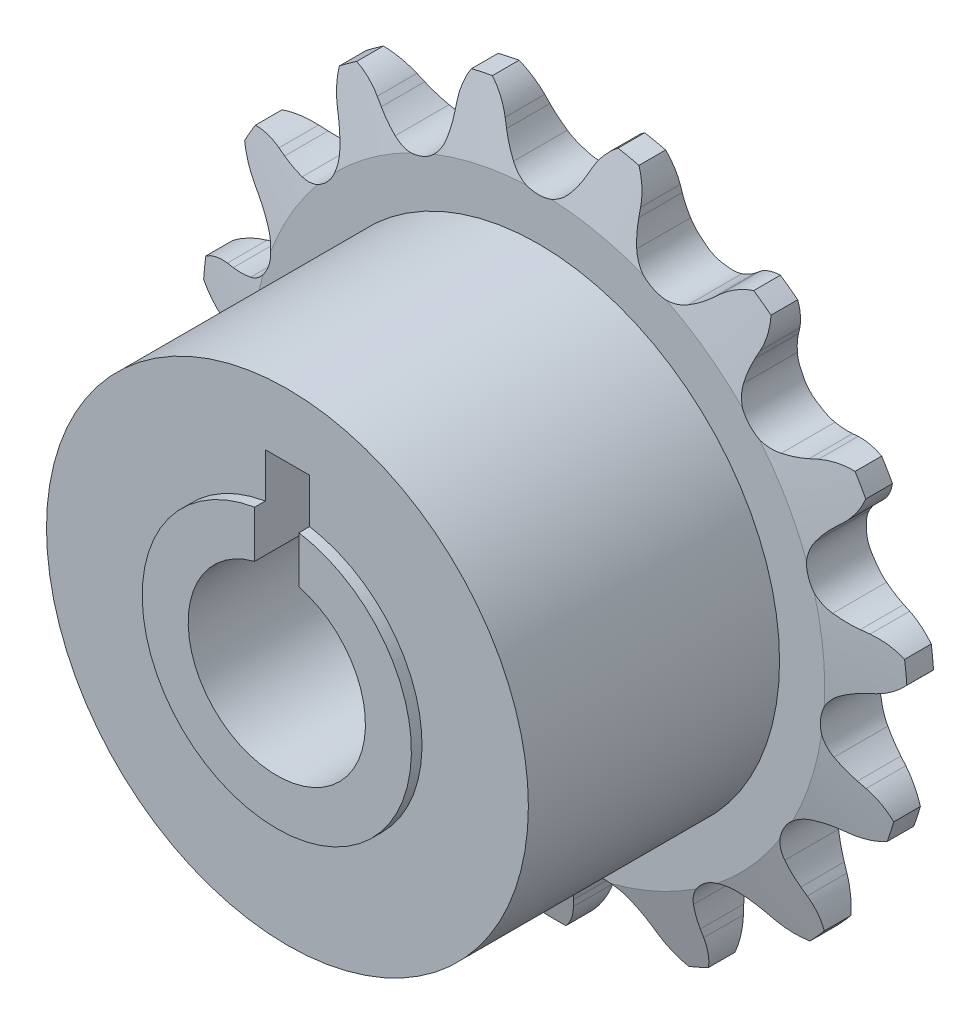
from build123d import *

# Parameters (mm, degrees)
TOOTH_CUT_NUMBER_OF_TEETH_15_DEPTH = 36.792112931
TOOTH_PATTERN_15_15_COUNT          = 15
SKETCH3_W                          = 17.9959
SKETCH3_H                          = 10.9140625
EXTRUDE1_DEPTH                     = 0.762
EXTRUDE1_DEPTH_BACK                = 23.0505
SKETCH4_R                          = 9.6440625
SKETCH4_R_2                        = 6.35
CUT_EXTRUDE1_DEPTH                 = 43.895045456


with BuildPart() as part:
    # Sprocket-BaseSketch → 35 _06C_ ANSI _ISO_ Chain Number_ 1.804i (revolve)
    with BuildSketch(Plane(origin=(0, 0, 0), x_dir=(0, 0, -1), z_dir=(1, 0, 0)), mode=Mode.PRIVATE) as f_35_06c_ansi_iso_chain_number_1_804i_sk:
        Polygon((2.1463, 6.35), (2.1463, 20.500800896), (0.955675, 25.263300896), (-0.955675, 25.263300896), (-2.1463, 20.500800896), (-2.1463, 6.35), align=None)
    revolve(f_35_06c_ansi_iso_chain_number_1_804i_sk.sketch.rotate(Axis((0, 0, -8.5852), (0, 0, 1)), 90), axis=Axis((0, 0, -8.5852), (0, 0, 1)))

    # Tooth-Sketch → Tooth-Cut_ Number of teeth_ 15 (cut, symmetric)
    with BuildSketch(Plane.XY):
        with BuildLine():
            Line((2.886000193, 22.679579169), (3.122841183, 23.193720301))
            ThreePointArc((3.122841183, 23.193720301), (4.680390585, 24.982321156), (6.956585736, 25.648645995))
            ThreePointArc((6.956585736, 25.648645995), (0, 26.575310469), (-6.956585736, 25.648645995))
            ThreePointArc((-6.956585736, 25.648645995), (-4.680390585, 24.982321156), (-3.122841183, 23.193720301))
            Line((-3.122841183, 23.193720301), (-2.886000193, 22.679579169))
            ThreePointArc((-2.886000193, 22.679579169), (-2.493460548, 21.950553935), (-2.013429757, 21.275916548))
            ThreePointArc((-2.013429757, 21.275916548), (0, 20.315559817), (2.013429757, 21.275916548))
            ThreePointArc((2.013429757, 21.275916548), (2.493460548, 21.950553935), (2.886000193, 22.679579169))
        make_face()
    tooth_cut_number_of_teeth_15 = extrude(amount=TOOTH_CUT_NUMBER_OF_TEETH_15_DEPTH, both=True, mode=Mode.SUBTRACT)

    # Tooth Pattern_ 15 _ 15: Tooth-Cut_ Number of teeth_ 15 ×15 about axis
    tooth_pattern_15_15_axis = Axis((0, 0, 0), (0, 0, 1))
    for i in range(1, TOOTH_PATTERN_15_15_COUNT):
        add(tooth_cut_number_of_teeth_15.rotate(tooth_pattern_15_15_axis, i * 360 / TOOTH_PATTERN_15_15_COUNT), mode=Mode.SUBTRACT)

    # Sketch3 → Hub-Revolve2 (revolve)
    with BuildSketch(Plane(origin=(0, 0, 0), x_dir=(0, 0, -1), z_dir=(1, 0, 0)), mode=Mode.PRIVATE) as hub_revolve2_sk:
        with Locations((-11.14425, 11.80703125)):
            Rectangle(SKETCH3_W, SKETCH3_H)
    revolve(hub_revolve2_sk.sketch.rotate(Axis((0, 0, -25.4), (0, 0, 1)), 90), axis=Axis((0, 0, -25.4), (0, 0, 1)))

    # Sketch4 → Extrude1 (add, two sides: drawn at the far end of the back side and taken through both)
    with BuildSketch(Plane.XY.offset(20.1422).offset(-EXTRUDE1_DEPTH_BACK)):
        Circle(SKETCH4_R)
        with Locations(Location((0, 0, 0), (0, 0, 180))):
            Circle(SKETCH4_R_2, mode=Mode.SUBTRACT)
    extrude(amount=EXTRUDE1_DEPTH + EXTRUDE1_DEPTH_BACK)

    # Sketch5 → Cut-Extrude1 (cut, through all)
    with BuildSketch(Plane(origin=(0, 0, -2.9083), x_dir=(-1, 0, 0), z_dir=(0, 0, -1))):
        with BuildLine():
            Line((1.5875, 6.35), (1.5875, 6.148361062))
            ThreePointArc((1.5875, 6.148361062), (0, 6.35), (-1.5875, 6.148361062))
            Line((-1.5875, 6.148361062), (-1.5875, 6.35))
            Line((-1.5875, 6.35), (-1.5875, 12.7))
            Line((-1.5875, 12.7), (1.5875, 12.7))
            Line((1.5875, 12.7), (1.5875, 6.35))
        make_face()
    extrude(amount=-CUT_EXTRUDE1_DEPTH, mode=Mode.SUBTRACT)


solid = part.part
